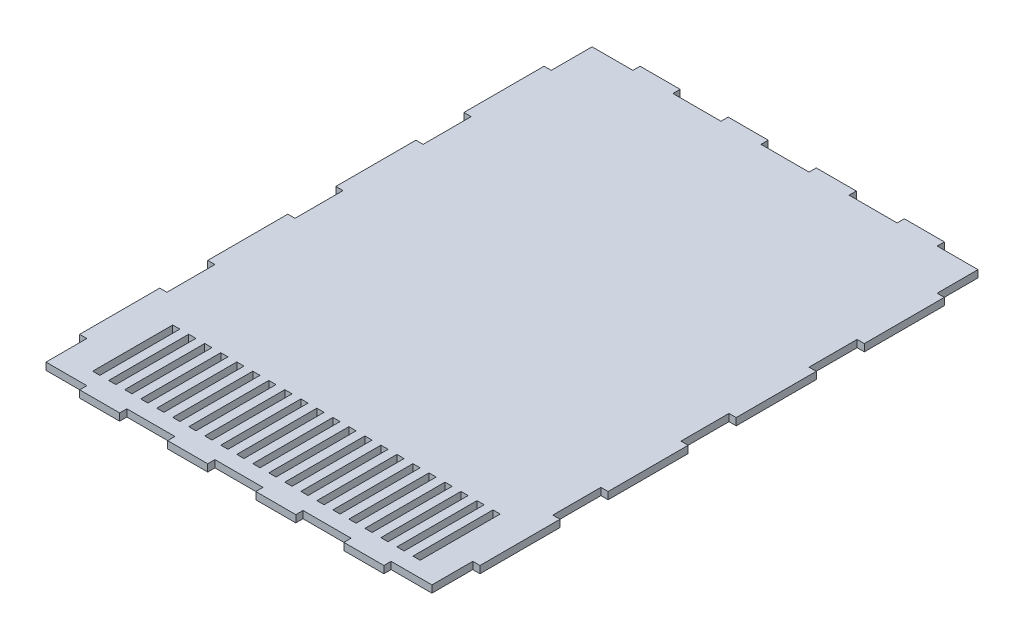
from build123d import *

# Parameters (mm, degrees)
SKETCH1_W           = 482
SKETCH1_H           = 682
BOSS_EXTRUDE1_DEPTH = 9
SKETCH3_W           = 50
SKETCH3_H           = 9
BOSS_EXTRUDE2_DEPTH = 9
SKETCH4_W           = 9
SKETCH4_H           = 100
BOSS_EXTRUDE3_DEPTH = 9
SKETCH5_W           = 9
SKETCH5_H           = 100
CUT_EXTRUDE1_DEPTH  = 431.210413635


with BuildPart() as part:
    # Sketch1 → Boss-Extrude1 (new body)
    with BuildSketch(Plane(origin=(0, 0, 0), x_dir=(1, 0, 0), z_dir=(0, 1, 0))):
        Rectangle(SKETCH1_W, SKETCH1_H)
    extrude(amount=BOSS_EXTRUDE1_DEPTH)

    # Sketch3 → Boss-Extrude2 (add)
    with BuildSketch(Plane(origin=(0, 9, 0), x_dir=(1, 0, 0), z_dir=(0, 1, 0))):
        with Locations((-165, 345.5)):
            Rectangle(SKETCH3_W, SKETCH3_H)
        with Locations((-55, 345.5)):
            Rectangle(SKETCH3_W, SKETCH3_H)
        with Locations((55, 345.5)):
            Rectangle(SKETCH3_W, SKETCH3_H)
        with Locations((165, 345.5)):
            Rectangle(SKETCH3_W, SKETCH3_H)
        with Locations((-165, -345.5)):
            Rectangle(SKETCH3_W, SKETCH3_H)
        with Locations((165, -345.5)):
            Rectangle(SKETCH3_W, SKETCH3_H)
        with Locations((55, -345.5)):
            Rectangle(SKETCH3_W, SKETCH3_H)
        with Locations((-55, -345.5)):
            Rectangle(SKETCH3_W, SKETCH3_H)
    extrude(amount=-BOSS_EXTRUDE2_DEPTH)

    # Sketch4 → Boss-Extrude3 (add)
    with BuildSketch(Plane(origin=(0, 9, 0), x_dir=(1, 0, 0), z_dir=(0, 1, 0))):
        with Locations((-245.5, 240)):
            Rectangle(SKETCH4_W, SKETCH4_H)
        with Locations((245.5, 240)):
            Rectangle(SKETCH4_W, SKETCH4_H)
        with Locations((-245.5, 80)):
            Rectangle(SKETCH4_W, SKETCH4_H)
        with Locations((245.5, 80)):
            Rectangle(SKETCH4_W, SKETCH4_H)
        with Locations((-245.5, -80)):
            Rectangle(SKETCH4_W, SKETCH4_H)
        with Locations((245.5, -80)):
            Rectangle(SKETCH4_W, SKETCH4_H)
        with Locations((-245.5, -240)):
            Rectangle(SKETCH4_W, SKETCH4_H)
        with Locations((245.5, -240)):
            Rectangle(SKETCH4_W, SKETCH4_H)
    extrude(amount=-BOSS_EXTRUDE3_DEPTH)

    # Sketch5 → Cut-Extrude1 (cut, through all)
    with BuildSketch(Plane(origin=(0, 9, 0), x_dir=(1, 0, 0), z_dir=(0, 1, 0))):
        with Locations((-177.5, -271.733226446)):
            Rectangle(SKETCH5_W, SKETCH5_H)
        with Locations((-197.5, -271.733226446)):
            Rectangle(SKETCH5_W, SKETCH5_H)
        with Locations((-157.5, -271.733226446)):
            Rectangle(SKETCH5_W, SKETCH5_H)
        with Locations((-137.5, -271.733226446)):
            Rectangle(SKETCH5_W, SKETCH5_H)
        with Locations((-117.5, -271.733226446)):
            Rectangle(SKETCH5_W, SKETCH5_H)
        with Locations((-97.5, -271.733226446)):
            Rectangle(SKETCH5_W, SKETCH5_H)
        with Locations((-77.5, -271.733226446)):
            Rectangle(SKETCH5_W, SKETCH5_H)
        with Locations((-57.5, -271.733226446)):
            Rectangle(SKETCH5_W, SKETCH5_H)
        with Locations((-37.5, -271.733226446)):
            Rectangle(SKETCH5_W, SKETCH5_H)
        with Locations((-17.5, -271.733226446)):
            Rectangle(SKETCH5_W, SKETCH5_H)
        with Locations((2.5, -271.733226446)):
            Rectangle(SKETCH5_W, SKETCH5_H)
        with Locations((22.5, -271.733226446)):
            Rectangle(SKETCH5_W, SKETCH5_H)
        with Locations((42.5, -271.733226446)):
            Rectangle(SKETCH5_W, SKETCH5_H)
        with Locations((62.5, -271.733226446)):
            Rectangle(SKETCH5_W, SKETCH5_H)
        with Locations((82.5, -271.733226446)):
            Rectangle(SKETCH5_W, SKETCH5_H)
        with Locations((102.5, -271.733226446)):
            Rectangle(SKETCH5_W, SKETCH5_H)
        with Locations((122.5, -271.733226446)):
            Rectangle(SKETCH5_W, SKETCH5_H)
        with Locations((142.5, -271.733226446)):
            Rectangle(SKETCH5_W, SKETCH5_H)
        with Locations((162.5, -271.733226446)):
            Rectangle(SKETCH5_W, SKETCH5_H)
        with Locations((182.5, -271.733226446)):
            Rectangle(SKETCH5_W, SKETCH5_H)
        with Locations((202.5, -271.733226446)):
            Rectangle(SKETCH5_W, SKETCH5_H)
    extrude(amount=-CUT_EXTRUDE1_DEPTH, mode=Mode.SUBTRACT)


solid = part.part
